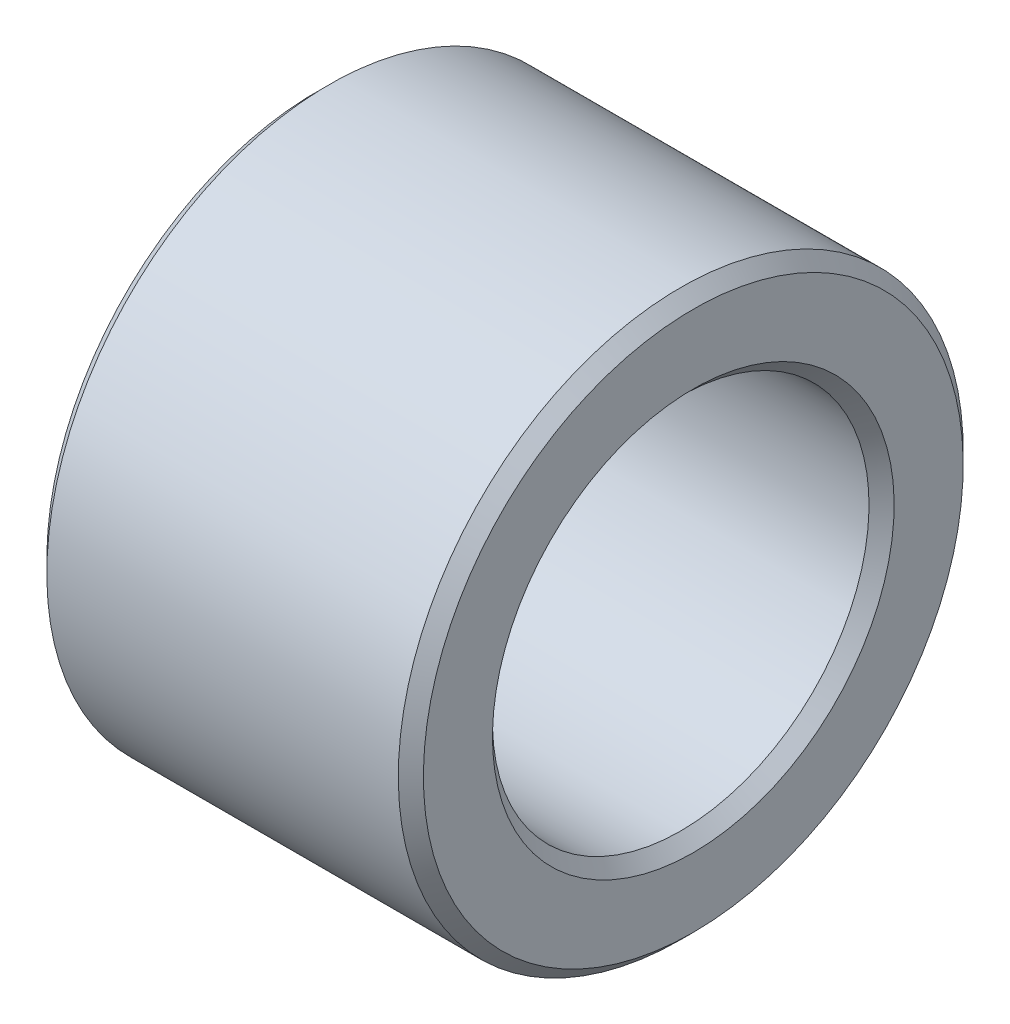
ISO-10303-21;
HEADER;
FILE_DESCRIPTION(('STEP AP214'),'2;1');
FILE_NAME('part.step','',(''),(''),'','','');
FILE_SCHEMA(('AUTOMOTIVE_DESIGN { 1 0 10303 214 1 1 1 1 }'));
ENDSEC;
DATA;
#1=APPLICATION_CONTEXT('core data for automotive mechanical design processes');
#2=APPLICATION_PROTOCOL_DEFINITION('international standard','automotive_design',2000,#1);
#3=PRODUCT_CONTEXT('',#1,'mechanical');
#4=PRODUCT('Part','Part','',(#3));
#5=PRODUCT_RELATED_PRODUCT_CATEGORY('part','',(#4));
#6=PRODUCT_DEFINITION_FORMATION('','',#4);
#7=PRODUCT_DEFINITION_CONTEXT('part definition',#1,'design');
#8=PRODUCT_DEFINITION('design','',#6,#7);
#9=PRODUCT_DEFINITION_SHAPE('','',#8);
#10=(LENGTH_UNIT() NAMED_UNIT(*) SI_UNIT(.MILLI.,.METRE.));
#11=(NAMED_UNIT(*) PLANE_ANGLE_UNIT() SI_UNIT($,.RADIAN.));
#12=(NAMED_UNIT(*) SI_UNIT($,.STERADIAN.) SOLID_ANGLE_UNIT());
#13=UNCERTAINTY_MEASURE_WITH_UNIT(LENGTH_MEASURE(1.E-05),#10,'distance_accuracy_value','');
#14=(GEOMETRIC_REPRESENTATION_CONTEXT(3) GLOBAL_UNCERTAINTY_ASSIGNED_CONTEXT((#13)) GLOBAL_UNIT_ASSIGNED_CONTEXT((#10,
#11,#12)) REPRESENTATION_CONTEXT('',''));
#15=CARTESIAN_POINT('',(0.,0.,0.));
#16=DIRECTION('',(0.,0.,1.));
#17=DIRECTION('',(1.,0.,0.));
#18=AXIS2_PLACEMENT_3D('',#15,#16,#17);
#19=CARTESIAN_POINT('',(0.,-7.5,0.));
#20=DIRECTION('',(-1.,0.,0.));
#21=DIRECTION('',(0.,1.,0.));
#22=AXIS2_PLACEMENT_3D('',#19,#20,#21);
#23=PLANE('',#22);
#24=CARTESIAN_POINT('',(0.,0.,0.));
#25=DIRECTION('',(1.,0.,0.));
#26=DIRECTION('',(0.,-1.,0.));
#27=AXIS2_PLACEMENT_3D('',#24,#25,#26);
#28=CIRCLE('',#27,6.4);
#29=CARTESIAN_POINT('',(0.,-6.4,0.));
#30=VERTEX_POINT('',#29);
#31=EDGE_CURVE('E9',#30,#30,#28,.T.);
#32=ORIENTED_EDGE('',*,*,#31,.T.);
#33=EDGE_LOOP('',(#32));
#34=FACE_BOUND('',#33,.T.);
#35=CARTESIAN_POINT('',(0.,0.,0.));
#36=DIRECTION('',(1.,0.,0.));
#37=DIRECTION('',(0.,-1.,0.));
#38=AXIS2_PLACEMENT_3D('',#35,#36,#37);
#39=CIRCLE('',#38,8.6);
#40=CARTESIAN_POINT('',(0.,-8.6,0.));
#41=VERTEX_POINT('',#40);
#42=EDGE_CURVE('E53',#41,#41,#39,.T.);
#43=ORIENTED_EDGE('',*,*,#42,.F.);
#44=EDGE_LOOP('',(#43));
#45=FACE_BOUND('',#44,.T.);
#46=ADVANCED_FACE('F15',(#34,#45),#23,.T.);
#47=CARTESIAN_POINT('',(0.2,0.,0.));
#48=DIRECTION('',(-1.,0.,0.));
#49=DIRECTION('',(0.,-1.,0.));
#50=AXIS2_PLACEMENT_3D('',#47,#48,#49);
#51=CONICAL_SURFACE('',#50,6.2,0.785398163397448);
#52=CARTESIAN_POINT('',(0.4,0.,0.));
#53=DIRECTION('',(1.,0.,0.));
#54=DIRECTION('',(0.,-1.,0.));
#55=AXIS2_PLACEMENT_3D('',#52,#53,#54);
#56=CIRCLE('',#55,6.);
#57=CARTESIAN_POINT('',(0.4,-6.,0.));
#58=VERTEX_POINT('',#57);
#59=EDGE_CURVE('E22',#58,#58,#56,.T.);
#60=ORIENTED_EDGE('',*,*,#59,.T.);
#61=EDGE_LOOP('',(#60));
#62=FACE_BOUND('',#61,.T.);
#63=ORIENTED_EDGE('',*,*,#31,.F.);
#64=EDGE_LOOP('',(#63));
#65=FACE_BOUND('',#64,.T.);
#66=ADVANCED_FACE('F82',(#62,#65),#51,.F.);
#67=CARTESIAN_POINT('',(6.,0.,0.));
#68=DIRECTION('',(-1.,0.,0.));
#69=DIRECTION('',(0.,-1.,0.));
#70=AXIS2_PLACEMENT_3D('',#67,#68,#69);
#71=CYLINDRICAL_SURFACE('',#70,6.);
#72=CARTESIAN_POINT('',(11.6,0.,0.));
#73=DIRECTION('',(1.,0.,0.));
#74=DIRECTION('',(0.,-1.,0.));
#75=AXIS2_PLACEMENT_3D('',#72,#73,#74);
#76=CIRCLE('',#75,6.);
#77=CARTESIAN_POINT('',(11.6,-6.,0.));
#78=VERTEX_POINT('',#77);
#79=EDGE_CURVE('E58',#78,#78,#76,.T.);
#80=ORIENTED_EDGE('',*,*,#79,.T.);
#81=EDGE_LOOP('',(#80));
#82=FACE_BOUND('',#81,.T.);
#83=ORIENTED_EDGE('',*,*,#59,.F.);
#84=EDGE_LOOP('',(#83));
#85=FACE_BOUND('',#84,.T.);
#86=ADVANCED_FACE('F66',(#82,#85),#71,.F.);
#87=CARTESIAN_POINT('',(11.8,0.,0.));
#88=DIRECTION('',(1.,0.,0.));
#89=DIRECTION('',(0.,-1.,0.));
#90=AXIS2_PLACEMENT_3D('',#87,#88,#89);
#91=CONICAL_SURFACE('',#90,6.2,0.785398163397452);
#92=CARTESIAN_POINT('',(12.,0.,0.));
#93=DIRECTION('',(1.,0.,0.));
#94=DIRECTION('',(0.,-1.,0.));
#95=AXIS2_PLACEMENT_3D('',#92,#93,#94);
#96=CIRCLE('',#95,6.4);
#97=CARTESIAN_POINT('',(12.,-6.4,0.));
#98=VERTEX_POINT('',#97);
#99=EDGE_CURVE('E63',#98,#98,#96,.T.);
#100=ORIENTED_EDGE('',*,*,#99,.T.);
#101=EDGE_LOOP('',(#100));
#102=FACE_BOUND('',#101,.T.);
#103=ORIENTED_EDGE('',*,*,#79,.F.);
#104=EDGE_LOOP('',(#103));
#105=FACE_BOUND('',#104,.T.);
#106=ADVANCED_FACE('F69',(#102,#105),#91,.F.);
#107=CARTESIAN_POINT('',(12.,-7.5,0.));
#108=DIRECTION('',(1.,0.,0.));
#109=DIRECTION('',(0.,-1.,0.));
#110=AXIS2_PLACEMENT_3D('',#107,#108,#109);
#111=PLANE('',#110);
#112=CARTESIAN_POINT('',(12.,0.,0.));
#113=DIRECTION('',(1.,0.,0.));
#114=DIRECTION('',(0.,-1.,0.));
#115=AXIS2_PLACEMENT_3D('',#112,#113,#114);
#116=CIRCLE('',#115,8.6);
#117=CARTESIAN_POINT('',(12.,-8.6,0.));
#118=VERTEX_POINT('',#117);
#119=EDGE_CURVE('E61',#118,#118,#116,.T.);
#120=ORIENTED_EDGE('',*,*,#119,.T.);
#121=EDGE_LOOP('',(#120));
#122=FACE_BOUND('',#121,.T.);
#123=ORIENTED_EDGE('',*,*,#99,.F.);
#124=EDGE_LOOP('',(#123));
#125=FACE_BOUND('',#124,.T.);
#126=ADVANCED_FACE('F71',(#122,#125),#111,.T.);
#127=CARTESIAN_POINT('',(11.8,0.,0.));
#128=DIRECTION('',(-1.,0.,0.));
#129=DIRECTION('',(0.,-1.,0.));
#130=AXIS2_PLACEMENT_3D('',#127,#128,#129);
#131=CONICAL_SURFACE('',#130,8.8,0.785398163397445);
#132=CARTESIAN_POINT('',(11.6,0.,0.));
#133=DIRECTION('',(1.,0.,0.));
#134=DIRECTION('',(0.,-1.,0.));
#135=AXIS2_PLACEMENT_3D('',#132,#133,#134);
#136=CIRCLE('',#135,9.);
#137=CARTESIAN_POINT('',(11.6,-9.,0.));
#138=VERTEX_POINT('',#137);
#139=EDGE_CURVE('E55',#138,#138,#136,.T.);
#140=ORIENTED_EDGE('',*,*,#139,.T.);
#141=EDGE_LOOP('',(#140));
#142=FACE_BOUND('',#141,.T.);
#143=ORIENTED_EDGE('',*,*,#119,.F.);
#144=EDGE_LOOP('',(#143));
#145=FACE_BOUND('',#144,.T.);
#146=ADVANCED_FACE('F79',(#142,#145),#131,.T.);
#147=CARTESIAN_POINT('',(6.,0.,0.));
#148=DIRECTION('',(-1.,0.,0.));
#149=DIRECTION('',(0.,-1.,0.));
#150=AXIS2_PLACEMENT_3D('',#147,#148,#149);
#151=CYLINDRICAL_SURFACE('',#150,9.);
#152=CARTESIAN_POINT('',(0.4,0.,0.));
#153=DIRECTION('',(1.,0.,0.));
#154=DIRECTION('',(0.,-1.,0.));
#155=AXIS2_PLACEMENT_3D('',#152,#153,#154);
#156=CIRCLE('',#155,9.);
#157=CARTESIAN_POINT('',(0.4,-9.,0.));
#158=VERTEX_POINT('',#157);
#159=EDGE_CURVE('E49',#158,#158,#156,.T.);
#160=ORIENTED_EDGE('',*,*,#159,.T.);
#161=EDGE_LOOP('',(#160));
#162=FACE_BOUND('',#161,.T.);
#163=ORIENTED_EDGE('',*,*,#139,.F.);
#164=EDGE_LOOP('',(#163));
#165=FACE_BOUND('',#164,.T.);
#166=ADVANCED_FACE('F50',(#162,#165),#151,.T.);
#167=CARTESIAN_POINT('',(0.2,0.,0.));
#168=DIRECTION('',(1.,0.,0.));
#169=DIRECTION('',(0.,-1.,0.));
#170=AXIS2_PLACEMENT_3D('',#167,#168,#169);
#171=CONICAL_SURFACE('',#170,8.8,0.785398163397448);
#172=ORIENTED_EDGE('',*,*,#42,.T.);
#173=EDGE_LOOP('',(#172));
#174=FACE_BOUND('',#173,.T.);
#175=ORIENTED_EDGE('',*,*,#159,.F.);
#176=EDGE_LOOP('',(#175));
#177=FACE_BOUND('',#176,.T.);
#178=ADVANCED_FACE('F92',(#174,#177),#171,.T.);
#179=CLOSED_SHELL('',(#46,#66,#86,#106,#126,#146,#166,#178));
#180=MANIFOLD_SOLID_BREP('B1',#179);
#181=ADVANCED_BREP_SHAPE_REPRESENTATION('',(#18,#180),#14);
#182=SHAPE_DEFINITION_REPRESENTATION(#9,#181);
ENDSEC;
END-ISO-10303-21;
